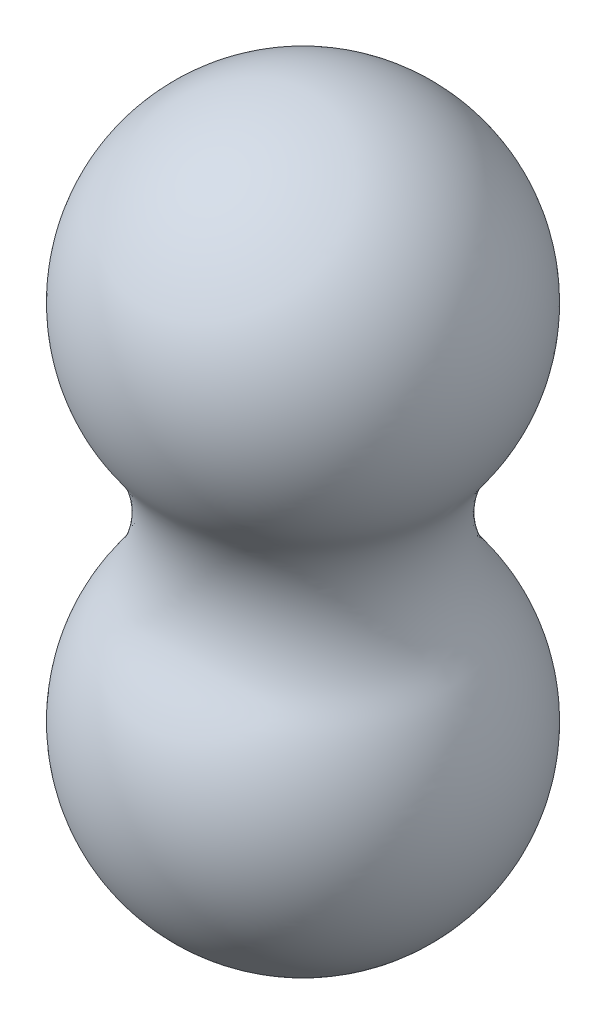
from build123d import *


with BuildPart() as part:
    # Szkic5 → Obr_t1 (revolve)
    with BuildSketch(Plane.XY):
        with BuildLine():
            Line((0, 0), (0, 60))
            add(Edge.make_bspline(
                [(0, 0), (12.115212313, 0), (18.671436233, 10.187948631), (13.652108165, 21.21449456), (13.355653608, 21.865751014), (12.66954241, 23.12583796), (11.337726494, 24.849788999), (10.739445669, 26.15888639), (10.513167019, 26.83772234), (9.822885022, 28.908568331), (9.822885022, 31.091431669), (10.513167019, 33.16227766), (10.739445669, 33.84111361), (11.337726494, 35.150211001), (12.66954241, 36.87416204), (13.355653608, 38.134248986), (13.652108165, 38.78550544), (18.671436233, 49.812051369), (12.115212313, 60), (0, 60)],
                knots=[0, 0, 0, 0, 0.362154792, 0.362154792, 0.362154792, 0.392971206, 0.42378762, 0.454604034, 0.454604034, 0.454604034, 0.545395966, 0.545395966, 0.545395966, 0.57621238, 0.607028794, 0.637845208, 0.637845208, 0.637845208, 1, 1, 1, 1], degree=3, weights=[1, 0.694104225, 0.694104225, 1, 1, 1, 1, 1, 1, 0.965788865, 0.965788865, 1, 1, 1, 1, 1, 1, 0.694104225, 0.694104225, 1]))
        make_face()
    revolve(axis=Axis((0, 0, 0), (0, 1, 0)))


solid = part.part
